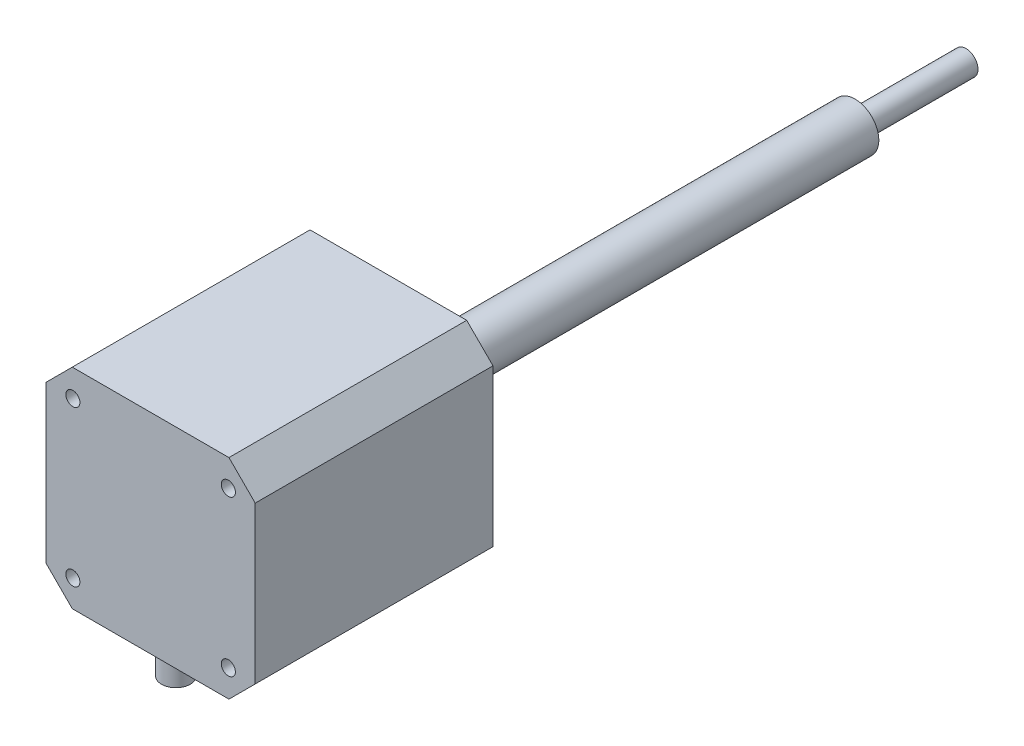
ISO-10303-21;
HEADER;
FILE_DESCRIPTION(('STEP AP214'),'2;1');
FILE_NAME('part.step','',(''),(''),'','','');
FILE_SCHEMA(('AUTOMOTIVE_DESIGN { 1 0 10303 214 1 1 1 1 }'));
ENDSEC;
DATA;
#1=APPLICATION_CONTEXT('core data for automotive mechanical design processes');
#2=APPLICATION_PROTOCOL_DEFINITION('international standard','automotive_design',2000,#1);
#3=PRODUCT_CONTEXT('',#1,'mechanical');
#4=PRODUCT('Part','Part','',(#3));
#5=PRODUCT_RELATED_PRODUCT_CATEGORY('part','',(#4));
#6=PRODUCT_DEFINITION_FORMATION('','',#4);
#7=PRODUCT_DEFINITION_CONTEXT('part definition',#1,'design');
#8=PRODUCT_DEFINITION('design','',#6,#7);
#9=PRODUCT_DEFINITION_SHAPE('','',#8);
#10=(LENGTH_UNIT() NAMED_UNIT(*) SI_UNIT(.MILLI.,.METRE.));
#11=(NAMED_UNIT(*) PLANE_ANGLE_UNIT() SI_UNIT($,.RADIAN.));
#12=(NAMED_UNIT(*) SI_UNIT($,.STERADIAN.) SOLID_ANGLE_UNIT());
#13=UNCERTAINTY_MEASURE_WITH_UNIT(LENGTH_MEASURE(1.E-05),#10,'distance_accuracy_value','');
#14=(GEOMETRIC_REPRESENTATION_CONTEXT(3) GLOBAL_UNCERTAINTY_ASSIGNED_CONTEXT((#13)) GLOBAL_UNIT_ASSIGNED_CONTEXT((#10,
#11,#12)) REPRESENTATION_CONTEXT('',''));
#15=CARTESIAN_POINT('',(0.,0.,0.));
#16=DIRECTION('',(0.,0.,1.));
#17=DIRECTION('',(1.,0.,0.));
#18=AXIS2_PLACEMENT_3D('',#15,#16,#17);
#19=CARTESIAN_POINT('',(-20.955,-20.955,47.625));
#20=DIRECTION('',(0.,0.,-1.));
#21=DIRECTION('',(-1.,0.,0.));
#22=AXIS2_PLACEMENT_3D('',#19,#20,#21);
#23=PLANE('',#22);
#24=DIRECTION('',(-0.707106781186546,0.707106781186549,0.));
#25=VECTOR('',#24,1.);
#26=CARTESIAN_POINT('',(20.740974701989,15.9044852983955,47.625));
#27=LINE('',#26,#25);
#28=CARTESIAN_POINT('',(20.955,15.6904600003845,47.625));
#29=VERTEX_POINT('',#28);
#30=CARTESIAN_POINT('',(15.6904600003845,20.955,47.625));
#31=VERTEX_POINT('',#30);
#32=EDGE_CURVE('E103',#29,#31,#27,.T.);
#33=ORIENTED_EDGE('',*,*,#32,.T.);
#34=DIRECTION('',(1.,0.,0.));
#35=VECTOR('',#34,1.);
#36=CARTESIAN_POINT('',(-20.955,20.955,47.625));
#37=LINE('',#36,#35);
#38=CARTESIAN_POINT('',(-15.6904600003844,20.955,47.625));
#39=VERTEX_POINT('',#38);
#40=EDGE_CURVE('E128',#39,#31,#37,.T.);
#41=ORIENTED_EDGE('',*,*,#40,.F.);
#42=DIRECTION('',(0.707106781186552,0.707106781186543,0.));
#43=VECTOR('',#42,1.);
#44=CARTESIAN_POINT('',(-15.9044852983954,20.740974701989,47.625));
#45=LINE('',#44,#43);
#46=CARTESIAN_POINT('',(-20.955,15.6904600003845,47.625));
#47=VERTEX_POINT('',#46);
#48=EDGE_CURVE('E181',#47,#39,#45,.T.);
#49=ORIENTED_EDGE('',*,*,#48,.F.);
#50=DIRECTION('',(0.,-1.,0.));
#51=VECTOR('',#50,1.);
#52=CARTESIAN_POINT('',(-20.955,20.955,47.625));
#53=LINE('',#52,#51);
#54=CARTESIAN_POINT('',(-20.955,-15.6904600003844,47.625));
#55=VERTEX_POINT('',#54);
#56=EDGE_CURVE('E134',#47,#55,#53,.T.);
#57=ORIENTED_EDGE('',*,*,#56,.T.);
#58=DIRECTION('',(-0.707106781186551,0.707106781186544,0.));
#59=VECTOR('',#58,1.);
#60=CARTESIAN_POINT('',(-15.9044852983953,-20.740974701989,47.625));
#61=LINE('',#60,#59);
#62=CARTESIAN_POINT('',(-15.6904600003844,-20.955,47.625));
#63=VERTEX_POINT('',#62);
#64=EDGE_CURVE('E122',#63,#55,#61,.T.);
#65=ORIENTED_EDGE('',*,*,#64,.F.);
#66=DIRECTION('',(-1.,0.,0.));
#67=VECTOR('',#66,1.);
#68=CARTESIAN_POINT('',(20.955,-20.955,47.625));
#69=LINE('',#68,#67);
#70=CARTESIAN_POINT('',(15.6904600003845,-20.955,47.625));
#71=VERTEX_POINT('',#70);
#72=EDGE_CURVE('E129',#71,#63,#69,.T.);
#73=ORIENTED_EDGE('',*,*,#72,.F.);
#74=DIRECTION('',(-0.707106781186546,-0.707106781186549,0.));
#75=VECTOR('',#74,1.);
#76=CARTESIAN_POINT('',(20.740974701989,-15.9044852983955,47.625));
#77=LINE('',#76,#75);
#78=CARTESIAN_POINT('',(20.955,-15.6904600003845,47.625));
#79=VERTEX_POINT('',#78);
#80=EDGE_CURVE('E127',#79,#71,#77,.T.);
#81=ORIENTED_EDGE('',*,*,#80,.F.);
#82=DIRECTION('',(0.,1.,0.));
#83=VECTOR('',#82,1.);
#84=CARTESIAN_POINT('',(20.955,-20.955,47.625));
#85=LINE('',#84,#83);
#86=EDGE_CURVE('E119',#79,#29,#85,.T.);
#87=ORIENTED_EDGE('',*,*,#86,.T.);
#88=EDGE_LOOP('',(#33,#41,#49,#57,#65,#73,#81,#87));
#89=FACE_BOUND('',#88,.T.);
#90=CARTESIAN_POINT('',(15.5702,-15.5702,47.625));
#91=DIRECTION('',(0.,0.,1.));
#92=DIRECTION('',(1.,0.,0.));
#93=AXIS2_PLACEMENT_3D('',#90,#91,#92);
#94=CIRCLE('',#93,1.4097);
#95=CARTESIAN_POINT('',(16.9799,-15.5702,47.625));
#96=VERTEX_POINT('',#95);
#97=EDGE_CURVE('E199',#96,#96,#94,.T.);
#98=ORIENTED_EDGE('',*,*,#97,.F.);
#99=EDGE_LOOP('',(#98));
#100=FACE_BOUND('',#99,.T.);
#101=CARTESIAN_POINT('',(15.5702,15.5702,47.625));
#102=DIRECTION('',(0.,0.,-1.));
#103=DIRECTION('',(-1.,0.,0.));
#104=AXIS2_PLACEMENT_3D('',#101,#102,#103);
#105=CIRCLE('',#104,1.4097);
#106=CARTESIAN_POINT('',(14.1605,15.5702,47.625));
#107=VERTEX_POINT('',#106);
#108=EDGE_CURVE('E195',#107,#107,#105,.T.);
#109=ORIENTED_EDGE('',*,*,#108,.T.);
#110=EDGE_LOOP('',(#109));
#111=FACE_BOUND('',#110,.T.);
#112=CARTESIAN_POINT('',(-15.5702,15.5702,47.625));
#113=DIRECTION('',(0.,0.,1.));
#114=DIRECTION('',(1.,0.,0.));
#115=AXIS2_PLACEMENT_3D('',#112,#113,#114);
#116=CIRCLE('',#115,1.4097);
#117=CARTESIAN_POINT('',(-14.1605,15.5702,47.625));
#118=VERTEX_POINT('',#117);
#119=EDGE_CURVE('E215',#118,#118,#116,.T.);
#120=ORIENTED_EDGE('',*,*,#119,.F.);
#121=EDGE_LOOP('',(#120));
#122=FACE_BOUND('',#121,.T.);
#123=CARTESIAN_POINT('',(-15.5702,-15.5702,47.625));
#124=DIRECTION('',(0.,0.,-1.));
#125=DIRECTION('',(-1.,0.,0.));
#126=AXIS2_PLACEMENT_3D('',#123,#124,#125);
#127=CIRCLE('',#126,1.4097);
#128=CARTESIAN_POINT('',(-16.9799,-15.5702,47.625));
#129=VERTEX_POINT('',#128);
#130=EDGE_CURVE('E218',#129,#129,#127,.T.);
#131=ORIENTED_EDGE('',*,*,#130,.T.);
#132=EDGE_LOOP('',(#131));
#133=FACE_BOUND('',#132,.T.);
#134=ADVANCED_FACE('F40',(#89,#100,#111,#122,#133),#23,.F.);
#135=CARTESIAN_POINT('',(-20.955,-20.955,0.));
#136=DIRECTION('',(0.,0.,-1.));
#137=DIRECTION('',(-1.,0.,0.));
#138=AXIS2_PLACEMENT_3D('',#135,#136,#137);
#139=PLANE('',#138);
#140=CARTESIAN_POINT('',(0.,0.,0.));
#141=DIRECTION('',(0.,0.,-1.));
#142=DIRECTION('',(-1.,0.,0.));
#143=AXIS2_PLACEMENT_3D('',#140,#141,#142);
#144=CIRCLE('',#143,3.175);
#145=CARTESIAN_POINT('',(-3.175,0.,0.));
#146=VERTEX_POINT('',#145);
#147=EDGE_CURVE('E11',#146,#146,#144,.T.);
#148=ORIENTED_EDGE('',*,*,#147,.F.);
#149=EDGE_LOOP('',(#148));
#150=FACE_BOUND('',#149,.T.);
#151=DIRECTION('',(1.,0.,0.));
#152=VECTOR('',#151,1.);
#153=CARTESIAN_POINT('',(-20.955,20.955,0.));
#154=LINE('',#153,#152);
#155=CARTESIAN_POINT('',(-15.6904600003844,20.955,0.));
#156=VERTEX_POINT('',#155);
#157=CARTESIAN_POINT('',(15.6904600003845,20.955,0.));
#158=VERTEX_POINT('',#157);
#159=EDGE_CURVE('E146',#156,#158,#154,.T.);
#160=ORIENTED_EDGE('',*,*,#159,.T.);
#161=DIRECTION('',(-0.707106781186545,0.70710678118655,0.));
#162=VECTOR('',#161,1.);
#163=CARTESIAN_POINT('',(15.9409150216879,20.7045449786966,0.));
#164=LINE('',#163,#162);
#165=CARTESIAN_POINT('',(20.955,15.6904600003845,0.));
#166=VERTEX_POINT('',#165);
#167=EDGE_CURVE('E55',#166,#158,#164,.T.);
#168=ORIENTED_EDGE('',*,*,#167,.F.);
#169=DIRECTION('',(0.,1.,0.));
#170=VECTOR('',#169,1.);
#171=CARTESIAN_POINT('',(20.955,-20.955,0.));
#172=LINE('',#171,#170);
#173=CARTESIAN_POINT('',(20.955,-15.6904600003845,0.));
#174=VERTEX_POINT('',#173);
#175=EDGE_CURVE('E121',#174,#166,#172,.T.);
#176=ORIENTED_EDGE('',*,*,#175,.F.);
#177=DIRECTION('',(0.707106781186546,0.707106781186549,0.));
#178=VECTOR('',#177,1.);
#179=CARTESIAN_POINT('',(-2.63226999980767,-39.2777300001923,0.));
#180=LINE('',#179,#178);
#181=CARTESIAN_POINT('',(15.6904600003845,-20.955,0.));
#182=VERTEX_POINT('',#181);
#183=EDGE_CURVE('E131',#182,#174,#180,.T.);
#184=ORIENTED_EDGE('',*,*,#183,.F.);
#185=DIRECTION('',(-1.,0.,0.));
#186=VECTOR('',#185,1.);
#187=CARTESIAN_POINT('',(20.955,-20.955,0.));
#188=LINE('',#187,#186);
#189=CARTESIAN_POINT('',(-15.6904600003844,-20.955,0.));
#190=VERTEX_POINT('',#189);
#191=EDGE_CURVE('E141',#182,#190,#188,.T.);
#192=ORIENTED_EDGE('',*,*,#191,.T.);
#193=DIRECTION('',(-0.707106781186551,0.707106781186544,0.));
#194=VECTOR('',#193,1.);
#195=CARTESIAN_POINT('',(-20.7045449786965,-15.940915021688,0.));
#196=LINE('',#195,#194);
#197=CARTESIAN_POINT('',(-20.955,-15.6904600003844,0.));
#198=VERTEX_POINT('',#197);
#199=EDGE_CURVE('E63',#190,#198,#196,.T.);
#200=ORIENTED_EDGE('',*,*,#199,.T.);
#201=DIRECTION('',(0.,-1.,0.));
#202=VECTOR('',#201,1.);
#203=CARTESIAN_POINT('',(-20.955,20.955,0.));
#204=LINE('',#203,#202);
#205=CARTESIAN_POINT('',(-20.955,15.6904600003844,0.));
#206=VERTEX_POINT('',#205);
#207=EDGE_CURVE('E138',#206,#198,#204,.T.);
#208=ORIENTED_EDGE('',*,*,#207,.F.);
#209=DIRECTION('',(-0.707106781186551,-0.707106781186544,0.));
#210=VECTOR('',#209,1.);
#211=CARTESIAN_POINT('',(-15.9044852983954,20.740974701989,0.));
#212=LINE('',#211,#210);
#213=EDGE_CURVE('E188',#156,#206,#212,.T.);
#214=ORIENTED_EDGE('',*,*,#213,.F.);
#215=EDGE_LOOP('',(#160,#168,#176,#184,#192,#200,#208,#214));
#216=FACE_BOUND('',#215,.T.);
#217=CARTESIAN_POINT('',(15.5702,-15.5702,0.));
#218=DIRECTION('',(0.,0.,1.));
#219=DIRECTION('',(1.,0.,0.));
#220=AXIS2_PLACEMENT_3D('',#217,#218,#219);
#221=CIRCLE('',#220,1.4097);
#222=CARTESIAN_POINT('',(16.9799,-15.5702,0.));
#223=VERTEX_POINT('',#222);
#224=EDGE_CURVE('E175',#223,#223,#221,.T.);
#225=ORIENTED_EDGE('',*,*,#224,.T.);
#226=EDGE_LOOP('',(#225));
#227=FACE_BOUND('',#226,.T.);
#228=CARTESIAN_POINT('',(15.5702,15.5702,0.));
#229=DIRECTION('',(0.,0.,-1.));
#230=DIRECTION('',(-1.,0.,0.));
#231=AXIS2_PLACEMENT_3D('',#228,#229,#230);
#232=CIRCLE('',#231,1.4097);
#233=CARTESIAN_POINT('',(14.1605,15.5702,0.));
#234=VERTEX_POINT('',#233);
#235=EDGE_CURVE('E196',#234,#234,#232,.T.);
#236=ORIENTED_EDGE('',*,*,#235,.F.);
#237=EDGE_LOOP('',(#236));
#238=FACE_BOUND('',#237,.T.);
#239=CARTESIAN_POINT('',(-15.5702,15.5702,0.));
#240=DIRECTION('',(0.,0.,1.));
#241=DIRECTION('',(1.,0.,0.));
#242=AXIS2_PLACEMENT_3D('',#239,#240,#241);
#243=CIRCLE('',#242,1.4097);
#244=CARTESIAN_POINT('',(-14.1605,15.5702,0.));
#245=VERTEX_POINT('',#244);
#246=EDGE_CURVE('E112',#245,#245,#243,.T.);
#247=ORIENTED_EDGE('',*,*,#246,.T.);
#248=EDGE_LOOP('',(#247));
#249=FACE_BOUND('',#248,.T.);
#250=CARTESIAN_POINT('',(-15.5702,-15.5702,0.));
#251=DIRECTION('',(0.,0.,-1.));
#252=DIRECTION('',(-1.,0.,0.));
#253=AXIS2_PLACEMENT_3D('',#250,#251,#252);
#254=CIRCLE('',#253,1.4097);
#255=CARTESIAN_POINT('',(-16.9799,-15.5702,0.));
#256=VERTEX_POINT('',#255);
#257=EDGE_CURVE('E220',#256,#256,#254,.T.);
#258=ORIENTED_EDGE('',*,*,#257,.F.);
#259=EDGE_LOOP('',(#258));
#260=FACE_BOUND('',#259,.T.);
#261=ADVANCED_FACE('F168',(#150,#216,#227,#238,#249,#260),#139,.T.);
#262=CARTESIAN_POINT('',(20.955,-20.955,47.625));
#263=DIRECTION('',(-1.,0.,0.));
#264=DIRECTION('',(0.,0.,1.));
#265=AXIS2_PLACEMENT_3D('',#262,#263,#264);
#266=PLANE('',#265);
#267=DIRECTION('',(0.,0.,-1.));
#268=VECTOR('',#267,1.);
#269=CARTESIAN_POINT('',(20.955,15.6904600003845,47.625));
#270=LINE('',#269,#268);
#271=EDGE_CURVE('E106',#29,#166,#270,.T.);
#272=ORIENTED_EDGE('',*,*,#271,.F.);
#273=ORIENTED_EDGE('',*,*,#86,.F.);
#274=DIRECTION('',(0.,0.,-1.));
#275=VECTOR('',#274,1.);
#276=CARTESIAN_POINT('',(20.955,-15.6904600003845,47.625));
#277=LINE('',#276,#275);
#278=EDGE_CURVE('E172',#79,#174,#277,.T.);
#279=ORIENTED_EDGE('',*,*,#278,.T.);
#280=ORIENTED_EDGE('',*,*,#175,.T.);
#281=EDGE_LOOP('',(#272,#273,#279,#280));
#282=FACE_BOUND('',#281,.T.);
#283=ADVANCED_FACE('F117',(#282),#266,.F.);
#284=CARTESIAN_POINT('',(-20.955,20.955,47.625));
#285=DIRECTION('',(0.,1.,0.));
#286=DIRECTION('',(-1.,0.,0.));
#287=AXIS2_PLACEMENT_3D('',#284,#285,#286);
#288=PLANE('',#287);
#289=ORIENTED_EDGE('',*,*,#40,.T.);
#290=DIRECTION('',(0.,0.,-1.));
#291=VECTOR('',#290,1.);
#292=CARTESIAN_POINT('',(15.6904600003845,20.955,47.625));
#293=LINE('',#292,#291);
#294=EDGE_CURVE('E107',#31,#158,#293,.T.);
#295=ORIENTED_EDGE('',*,*,#294,.T.);
#296=ORIENTED_EDGE('',*,*,#159,.F.);
#297=DIRECTION('',(0.,0.,-1.));
#298=VECTOR('',#297,1.);
#299=CARTESIAN_POINT('',(-15.6904600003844,20.955,47.625));
#300=LINE('',#299,#298);
#301=EDGE_CURVE('E150',#39,#156,#300,.T.);
#302=ORIENTED_EDGE('',*,*,#301,.F.);
#303=EDGE_LOOP('',(#289,#295,#296,#302));
#304=FACE_BOUND('',#303,.T.);
#305=ADVANCED_FACE('F267',(#304),#288,.T.);
#306=CARTESIAN_POINT('',(-20.955,20.955,47.625));
#307=DIRECTION('',(1.,0.,0.));
#308=DIRECTION('',(0.,1.,0.));
#309=AXIS2_PLACEMENT_3D('',#306,#307,#308);
#310=PLANE('',#309);
#311=ORIENTED_EDGE('',*,*,#207,.T.);
#312=DIRECTION('',(0.,0.,1.));
#313=VECTOR('',#312,1.);
#314=CARTESIAN_POINT('',(-20.955,-15.6904600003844,47.625));
#315=LINE('',#314,#313);
#316=EDGE_CURVE('E186',#198,#55,#315,.T.);
#317=ORIENTED_EDGE('',*,*,#316,.T.);
#318=ORIENTED_EDGE('',*,*,#56,.F.);
#319=DIRECTION('',(0.,0.,-1.));
#320=VECTOR('',#319,1.);
#321=CARTESIAN_POINT('',(-20.955,15.6904600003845,47.625));
#322=LINE('',#321,#320);
#323=EDGE_CURVE('E185',#47,#206,#322,.T.);
#324=ORIENTED_EDGE('',*,*,#323,.T.);
#325=EDGE_LOOP('',(#311,#317,#318,#324));
#326=FACE_BOUND('',#325,.T.);
#327=ADVANCED_FACE('F42',(#326),#310,.F.);
#328=CARTESIAN_POINT('',(20.955,-20.955,47.625));
#329=DIRECTION('',(0.,-1.,0.));
#330=DIRECTION('',(1.,0.,0.));
#331=AXIS2_PLACEMENT_3D('',#328,#329,#330);
#332=PLANE('',#331);
#333=CARTESIAN_POINT('',(0.,-20.955,42.5537500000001));
#334=DIRECTION('',(0.,-1.,0.));
#335=DIRECTION('',(1.,0.,0.));
#336=AXIS2_PLACEMENT_3D('',#333,#334,#335);
#337=CIRCLE('',#336,2.8956);
#338=CARTESIAN_POINT('',(2.8956,-20.955,42.5537500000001));
#339=VERTEX_POINT('',#338);
#340=EDGE_CURVE('E48',#339,#339,#337,.T.);
#341=ORIENTED_EDGE('',*,*,#340,.F.);
#342=EDGE_LOOP('',(#341));
#343=FACE_BOUND('',#342,.T.);
#344=DIRECTION('',(0.,0.,1.));
#345=VECTOR('',#344,1.);
#346=CARTESIAN_POINT('',(-15.6904600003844,-20.955,47.625));
#347=LINE('',#346,#345);
#348=EDGE_CURVE('E152',#190,#63,#347,.T.);
#349=ORIENTED_EDGE('',*,*,#348,.F.);
#350=ORIENTED_EDGE('',*,*,#191,.F.);
#351=DIRECTION('',(0.,0.,-1.));
#352=VECTOR('',#351,1.);
#353=CARTESIAN_POINT('',(15.6904600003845,-20.955,47.625));
#354=LINE('',#353,#352);
#355=EDGE_CURVE('E142',#71,#182,#354,.T.);
#356=ORIENTED_EDGE('',*,*,#355,.F.);
#357=ORIENTED_EDGE('',*,*,#72,.T.);
#358=EDGE_LOOP('',(#349,#350,#356,#357));
#359=FACE_BOUND('',#358,.T.);
#360=ADVANCED_FACE('F159',(#343,#359),#332,.T.);
#361=CARTESIAN_POINT('',(20.740974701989,-15.9044852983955,0.));
#362=DIRECTION('',(-0.707106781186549,0.707106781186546,0.));
#363=DIRECTION('',(-0.707106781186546,-0.707106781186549,0.));
#364=AXIS2_PLACEMENT_3D('',#361,#362,#363);
#365=PLANE('',#364);
#366=ORIENTED_EDGE('',*,*,#355,.T.);
#367=ORIENTED_EDGE('',*,*,#183,.T.);
#368=ORIENTED_EDGE('',*,*,#278,.F.);
#369=ORIENTED_EDGE('',*,*,#80,.T.);
#370=EDGE_LOOP('',(#366,#367,#368,#369));
#371=FACE_BOUND('',#370,.T.);
#372=ADVANCED_FACE('F162',(#371),#365,.F.);
#373=CARTESIAN_POINT('',(15.5702,-15.5702,0.));
#374=DIRECTION('',(0.,0.,1.));
#375=DIRECTION('',(1.,0.,0.));
#376=AXIS2_PLACEMENT_3D('',#373,#374,#375);
#377=CYLINDRICAL_SURFACE('',#376,1.4097);
#378=ORIENTED_EDGE('',*,*,#224,.F.);
#379=EDGE_LOOP('',(#378));
#380=FACE_BOUND('',#379,.T.);
#381=ORIENTED_EDGE('',*,*,#97,.T.);
#382=EDGE_LOOP('',(#381));
#383=FACE_BOUND('',#382,.T.);
#384=ADVANCED_FACE('F206',(#380,#383),#377,.F.);
#385=CARTESIAN_POINT('',(15.5702,15.5702,0.));
#386=DIRECTION('',(0.,0.,1.));
#387=DIRECTION('',(1.,0.,0.));
#388=AXIS2_PLACEMENT_3D('',#385,#386,#387);
#389=CYLINDRICAL_SURFACE('',#388,1.4097);
#390=ORIENTED_EDGE('',*,*,#235,.T.);
#391=EDGE_LOOP('',(#390));
#392=FACE_BOUND('',#391,.T.);
#393=ORIENTED_EDGE('',*,*,#108,.F.);
#394=EDGE_LOOP('',(#393));
#395=FACE_BOUND('',#394,.T.);
#396=ADVANCED_FACE('F254',(#392,#395),#389,.F.);
#397=CARTESIAN_POINT('',(-15.9044852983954,20.740974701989,0.));
#398=DIRECTION('',(0.707106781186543,-0.707106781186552,0.));
#399=DIRECTION('',(0.707106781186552,0.707106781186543,0.));
#400=AXIS2_PLACEMENT_3D('',#397,#398,#399);
#401=PLANE('',#400);
#402=ORIENTED_EDGE('',*,*,#48,.T.);
#403=ORIENTED_EDGE('',*,*,#301,.T.);
#404=ORIENTED_EDGE('',*,*,#213,.T.);
#405=ORIENTED_EDGE('',*,*,#323,.F.);
#406=EDGE_LOOP('',(#402,#403,#404,#405));
#407=FACE_BOUND('',#406,.T.);
#408=ADVANCED_FACE('F251',(#407),#401,.F.);
#409=CARTESIAN_POINT('',(-15.9044852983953,-20.740974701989,0.));
#410=DIRECTION('',(0.707106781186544,0.707106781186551,0.));
#411=DIRECTION('',(-0.707106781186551,0.707106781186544,0.));
#412=AXIS2_PLACEMENT_3D('',#409,#410,#411);
#413=PLANE('',#412);
#414=ORIENTED_EDGE('',*,*,#199,.F.);
#415=ORIENTED_EDGE('',*,*,#348,.T.);
#416=ORIENTED_EDGE('',*,*,#64,.T.);
#417=ORIENTED_EDGE('',*,*,#316,.F.);
#418=EDGE_LOOP('',(#414,#415,#416,#417));
#419=FACE_BOUND('',#418,.T.);
#420=ADVANCED_FACE('F244',(#419),#413,.F.);
#421=CARTESIAN_POINT('',(20.740974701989,15.9044852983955,0.));
#422=DIRECTION('',(0.707106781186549,0.707106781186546,0.));
#423=DIRECTION('',(-0.707106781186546,0.707106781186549,0.));
#424=AXIS2_PLACEMENT_3D('',#421,#422,#423);
#425=PLANE('',#424);
#426=ORIENTED_EDGE('',*,*,#271,.T.);
#427=ORIENTED_EDGE('',*,*,#167,.T.);
#428=ORIENTED_EDGE('',*,*,#294,.F.);
#429=ORIENTED_EDGE('',*,*,#32,.F.);
#430=EDGE_LOOP('',(#426,#427,#428,#429));
#431=FACE_BOUND('',#430,.T.);
#432=ADVANCED_FACE('F105',(#431),#425,.T.);
#433=CARTESIAN_POINT('',(-15.5702,15.5702,0.));
#434=DIRECTION('',(0.,0.,1.));
#435=DIRECTION('',(1.,0.,0.));
#436=AXIS2_PLACEMENT_3D('',#433,#434,#435);
#437=CYLINDRICAL_SURFACE('',#436,1.4097);
#438=ORIENTED_EDGE('',*,*,#246,.F.);
#439=EDGE_LOOP('',(#438));
#440=FACE_BOUND('',#439,.T.);
#441=ORIENTED_EDGE('',*,*,#119,.T.);
#442=EDGE_LOOP('',(#441));
#443=FACE_BOUND('',#442,.T.);
#444=ADVANCED_FACE('F233',(#440,#443),#437,.F.);
#445=CARTESIAN_POINT('',(-15.5702,-15.5702,0.));
#446=DIRECTION('',(0.,0.,1.));
#447=DIRECTION('',(1.,0.,0.));
#448=AXIS2_PLACEMENT_3D('',#445,#446,#447);
#449=CYLINDRICAL_SURFACE('',#448,1.4097);
#450=ORIENTED_EDGE('',*,*,#257,.T.);
#451=EDGE_LOOP('',(#450));
#452=FACE_BOUND('',#451,.T.);
#453=ORIENTED_EDGE('',*,*,#130,.F.);
#454=EDGE_LOOP('',(#453));
#455=FACE_BOUND('',#454,.T.);
#456=ADVANCED_FACE('F235',(#452,#455),#449,.F.);
#457=CARTESIAN_POINT('',(0.,-27.305,42.5537500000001));
#458=DIRECTION('',(0.,1.,0.));
#459=DIRECTION('',(-1.,0.,0.));
#460=AXIS2_PLACEMENT_3D('',#457,#458,#459);
#461=CYLINDRICAL_SURFACE('',#460,2.8956);
#462=CARTESIAN_POINT('',(0.,-27.305,42.5537500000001));
#463=DIRECTION('',(0.,1.,0.));
#464=DIRECTION('',(-1.,0.,0.));
#465=AXIS2_PLACEMENT_3D('',#462,#463,#464);
#466=CIRCLE('',#465,2.8956);
#467=CARTESIAN_POINT('',(-2.89560000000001,-27.305,42.5537500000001));
#468=VERTEX_POINT('',#467);
#469=EDGE_CURVE('E221',#468,#468,#466,.T.);
#470=ORIENTED_EDGE('',*,*,#469,.T.);
#471=EDGE_LOOP('',(#470));
#472=FACE_BOUND('',#471,.T.);
#473=ORIENTED_EDGE('',*,*,#340,.T.);
#474=EDGE_LOOP('',(#473));
#475=FACE_BOUND('',#474,.T.);
#476=ADVANCED_FACE('F157',(#472,#475),#461,.T.);
#477=CARTESIAN_POINT('',(0.,-27.305,42.5537500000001));
#478=DIRECTION('',(0.,1.,0.));
#479=DIRECTION('',(-1.,0.,0.));
#480=AXIS2_PLACEMENT_3D('',#477,#478,#479);
#481=PLANE('',#480);
#482=ORIENTED_EDGE('',*,*,#469,.F.);
#483=EDGE_LOOP('',(#482));
#484=FACE_BOUND('',#483,.T.);
#485=ADVANCED_FACE('F334',(#484),#481,.F.);
#486=CARTESIAN_POINT('',(0.,2.413,-115.697));
#487=DIRECTION('',(0.,0.,-1.));
#488=DIRECTION('',(-1.,0.,0.));
#489=AXIS2_PLACEMENT_3D('',#486,#487,#488);
#490=PLANE('',#489);
#491=CARTESIAN_POINT('',(0.,0.,-115.697));
#492=DIRECTION('',(0.,0.,-1.));
#493=DIRECTION('',(-1.,0.,0.));
#494=AXIS2_PLACEMENT_3D('',#491,#492,#493);
#495=CIRCLE('',#494,2.413);
#496=CARTESIAN_POINT('',(-2.413,0.,-115.697));
#497=VERTEX_POINT('',#496);
#498=EDGE_CURVE('E226',#497,#497,#495,.T.);
#499=ORIENTED_EDGE('',*,*,#498,.T.);
#500=EDGE_LOOP('',(#499));
#501=FACE_BOUND('',#500,.T.);
#502=ADVANCED_FACE('F340',(#501),#490,.T.);
#503=CARTESIAN_POINT('',(0.,0.,0.));
#504=DIRECTION('',(0.,0.,-1.));
#505=DIRECTION('',(-1.,0.,0.));
#506=AXIS2_PLACEMENT_3D('',#503,#504,#505);
#507=CYLINDRICAL_SURFACE('',#506,2.413);
#508=CARTESIAN_POINT('',(0.,0.,-93.472));
#509=DIRECTION('',(0.,0.,-1.));
#510=DIRECTION('',(-1.,0.,0.));
#511=AXIS2_PLACEMENT_3D('',#508,#509,#510);
#512=CIRCLE('',#511,2.413);
#513=CARTESIAN_POINT('',(-2.413,0.,-93.472));
#514=VERTEX_POINT('',#513);
#515=EDGE_CURVE('E426',#514,#514,#512,.T.);
#516=ORIENTED_EDGE('',*,*,#515,.T.);
#517=EDGE_LOOP('',(#516));
#518=FACE_BOUND('',#517,.T.);
#519=ORIENTED_EDGE('',*,*,#498,.F.);
#520=EDGE_LOOP('',(#519));
#521=FACE_BOUND('',#520,.T.);
#522=ADVANCED_FACE('F348',(#518,#521),#507,.T.);
#523=CARTESIAN_POINT('',(0.,4.7625,-93.472));
#524=DIRECTION('',(0.,0.,-1.));
#525=DIRECTION('',(-1.,0.,0.));
#526=AXIS2_PLACEMENT_3D('',#523,#524,#525);
#527=PLANE('',#526);
#528=CARTESIAN_POINT('',(0.,0.,-93.472));
#529=DIRECTION('',(0.,0.,-1.));
#530=DIRECTION('',(-1.,0.,0.));
#531=AXIS2_PLACEMENT_3D('',#528,#529,#530);
#532=CIRCLE('',#531,4.7625);
#533=CARTESIAN_POINT('',(-4.7625,0.,-93.472));
#534=VERTEX_POINT('',#533);
#535=EDGE_CURVE('E421',#534,#534,#532,.T.);
#536=ORIENTED_EDGE('',*,*,#535,.T.);
#537=EDGE_LOOP('',(#536));
#538=FACE_BOUND('',#537,.T.);
#539=ORIENTED_EDGE('',*,*,#515,.F.);
#540=EDGE_LOOP('',(#539));
#541=FACE_BOUND('',#540,.T.);
#542=ADVANCED_FACE('F357',(#538,#541),#527,.T.);
#543=CARTESIAN_POINT('',(0.,0.,0.));
#544=DIRECTION('',(0.,0.,-1.));
#545=DIRECTION('',(-1.,0.,0.));
#546=AXIS2_PLACEMENT_3D('',#543,#544,#545);
#547=CYLINDRICAL_SURFACE('',#546,4.7625);
#548=CARTESIAN_POINT('',(0.,0.,-12.7));
#549=DIRECTION('',(0.,0.,-1.));
#550=DIRECTION('',(-1.,0.,0.));
#551=AXIS2_PLACEMENT_3D('',#548,#549,#550);
#552=CIRCLE('',#551,4.7625);
#553=CARTESIAN_POINT('',(-4.7625,0.,-12.7));
#554=VERTEX_POINT('',#553);
#555=EDGE_CURVE('E418',#554,#554,#552,.T.);
#556=ORIENTED_EDGE('',*,*,#555,.T.);
#557=EDGE_LOOP('',(#556));
#558=FACE_BOUND('',#557,.T.);
#559=ORIENTED_EDGE('',*,*,#535,.F.);
#560=EDGE_LOOP('',(#559));
#561=FACE_BOUND('',#560,.T.);
#562=ADVANCED_FACE('F365',(#558,#561),#547,.T.);
#563=CARTESIAN_POINT('',(0.,3.175,-12.7));
#564=DIRECTION('',(0.,0.,1.));
#565=DIRECTION('',(1.,0.,0.));
#566=AXIS2_PLACEMENT_3D('',#563,#564,#565);
#567=PLANE('',#566);
#568=CARTESIAN_POINT('',(0.,0.,-12.7));
#569=DIRECTION('',(0.,0.,-1.));
#570=DIRECTION('',(-1.,0.,0.));
#571=AXIS2_PLACEMENT_3D('',#568,#569,#570);
#572=CIRCLE('',#571,3.175);
#573=CARTESIAN_POINT('',(-3.175,0.,-12.7));
#574=VERTEX_POINT('',#573);
#575=EDGE_CURVE('E417',#574,#574,#572,.T.);
#576=ORIENTED_EDGE('',*,*,#575,.T.);
#577=EDGE_LOOP('',(#576));
#578=FACE_BOUND('',#577,.T.);
#579=ORIENTED_EDGE('',*,*,#555,.F.);
#580=EDGE_LOOP('',(#579));
#581=FACE_BOUND('',#580,.T.);
#582=ADVANCED_FACE('F374',(#578,#581),#567,.T.);
#583=CARTESIAN_POINT('',(0.,0.,0.));
#584=DIRECTION('',(0.,0.,-1.));
#585=DIRECTION('',(-1.,0.,0.));
#586=AXIS2_PLACEMENT_3D('',#583,#584,#585);
#587=CYLINDRICAL_SURFACE('',#586,3.175);
#588=ORIENTED_EDGE('',*,*,#147,.T.);
#589=EDGE_LOOP('',(#588));
#590=FACE_BOUND('',#589,.T.);
#591=ORIENTED_EDGE('',*,*,#575,.F.);
#592=EDGE_LOOP('',(#591));
#593=FACE_BOUND('',#592,.T.);
#594=ADVANCED_FACE('F381',(#590,#593),#587,.T.);
#595=CLOSED_SHELL('',(#134,#261,#283,#305,#327,#360,#372,#384,#396,#408,#420,#432,#444,#456,
#476,#485,#502,#522,#542,#562,#582,#594));
#596=MANIFOLD_SOLID_BREP('B2',#595);
#597=ADVANCED_BREP_SHAPE_REPRESENTATION('',(#18,#596),#14);
#598=SHAPE_DEFINITION_REPRESENTATION(#9,#597);
ENDSEC;
END-ISO-10303-21;
